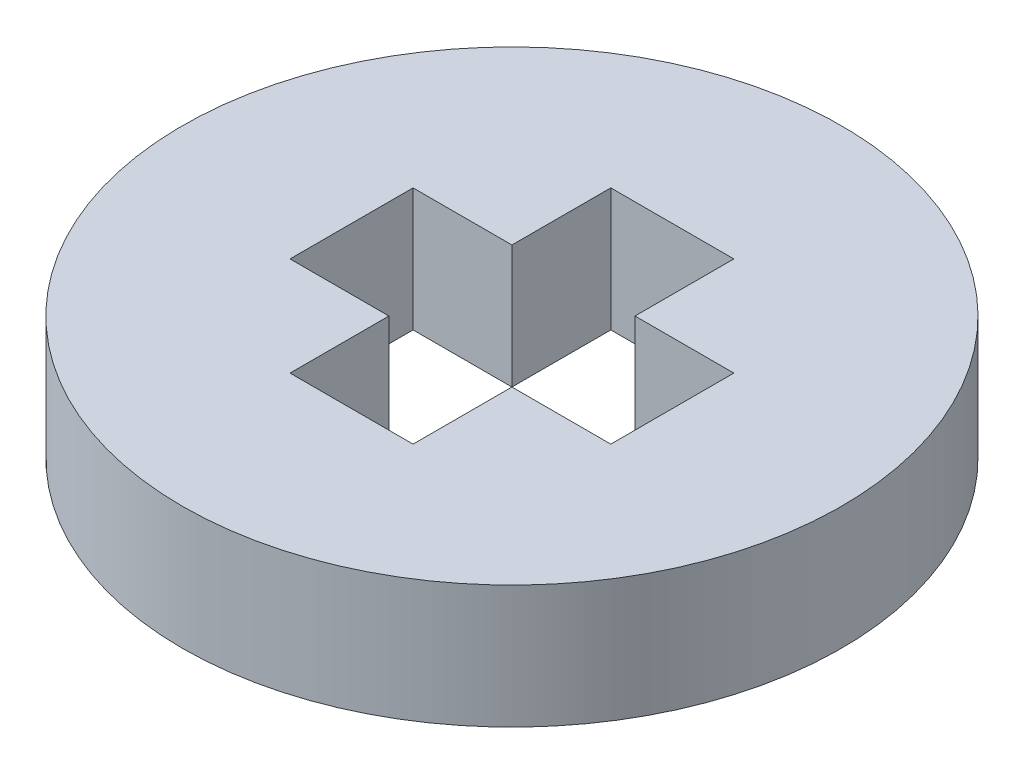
ISO-10303-21;
HEADER;
FILE_DESCRIPTION(('STEP AP214'),'2;1');
FILE_NAME('part.step','',(''),(''),'','','');
FILE_SCHEMA(('AUTOMOTIVE_DESIGN { 1 0 10303 214 1 1 1 1 }'));
ENDSEC;
DATA;
#1=APPLICATION_CONTEXT('core data for automotive mechanical design processes');
#2=APPLICATION_PROTOCOL_DEFINITION('international standard','automotive_design',2000,#1);
#3=PRODUCT_CONTEXT('',#1,'mechanical');
#4=PRODUCT('Part','Part','',(#3));
#5=PRODUCT_RELATED_PRODUCT_CATEGORY('part','',(#4));
#6=PRODUCT_DEFINITION_FORMATION('','',#4);
#7=PRODUCT_DEFINITION_CONTEXT('part definition',#1,'design');
#8=PRODUCT_DEFINITION('design','',#6,#7);
#9=PRODUCT_DEFINITION_SHAPE('','',#8);
#10=(LENGTH_UNIT() NAMED_UNIT(*) SI_UNIT(.MILLI.,.METRE.));
#11=(NAMED_UNIT(*) PLANE_ANGLE_UNIT() SI_UNIT($,.RADIAN.));
#12=(NAMED_UNIT(*) SI_UNIT($,.STERADIAN.) SOLID_ANGLE_UNIT());
#13=UNCERTAINTY_MEASURE_WITH_UNIT(LENGTH_MEASURE(1.E-05),#10,'distance_accuracy_value','');
#14=(GEOMETRIC_REPRESENTATION_CONTEXT(3) GLOBAL_UNCERTAINTY_ASSIGNED_CONTEXT((#13)) GLOBAL_UNIT_ASSIGNED_CONTEXT((#10,
#11,#12)) REPRESENTATION_CONTEXT('',''));
#15=CARTESIAN_POINT('',(0.,0.,0.));
#16=DIRECTION('',(0.,0.,1.));
#17=DIRECTION('',(1.,0.,0.));
#18=AXIS2_PLACEMENT_3D('',#15,#16,#17);
#19=CARTESIAN_POINT('',(0.,2.8,0.));
#20=DIRECTION('',(0.,1.,0.));
#21=DIRECTION('',(0.,0.,1.));
#22=AXIS2_PLACEMENT_3D('',#19,#20,#21);
#23=PLANE('',#22);
#24=CARTESIAN_POINT('',(0.,2.8,0.));
#25=DIRECTION('',(0.,1.,0.));
#26=DIRECTION('',(0.,0.,1.));
#27=AXIS2_PLACEMENT_3D('',#24,#25,#26);
#28=CIRCLE('',#27,7.5);
#29=CARTESIAN_POINT('',(0.,2.8,7.5));
#30=VERTEX_POINT('',#29);
#31=EDGE_CURVE('E11',#30,#30,#28,.T.);
#32=ORIENTED_EDGE('',*,*,#31,.T.);
#33=EDGE_LOOP('',(#32));
#34=FACE_BOUND('',#33,.T.);
#35=DIRECTION('',(-1.,0.,0.));
#36=VECTOR('',#35,1.);
#37=CARTESIAN_POINT('',(1.4,2.8,-3.65));
#38=LINE('',#37,#36);
#39=CARTESIAN_POINT('',(1.4,2.8,-3.65));
#40=VERTEX_POINT('',#39);
#41=CARTESIAN_POINT('',(-1.4,2.8,-3.65));
#42=VERTEX_POINT('',#41);
#43=EDGE_CURVE('E138',#40,#42,#38,.T.);
#44=ORIENTED_EDGE('',*,*,#43,.F.);
#45=DIRECTION('',(0.,0.,-1.));
#46=VECTOR('',#45,1.);
#47=CARTESIAN_POINT('',(1.4,2.8,-1.4));
#48=LINE('',#47,#46);
#49=CARTESIAN_POINT('',(1.4,2.8,-1.4));
#50=VERTEX_POINT('',#49);
#51=EDGE_CURVE('E130',#50,#40,#48,.T.);
#52=ORIENTED_EDGE('',*,*,#51,.F.);
#53=DIRECTION('',(-1.,0.,0.));
#54=VECTOR('',#53,1.);
#55=CARTESIAN_POINT('',(3.65,2.8,-1.4));
#56=LINE('',#55,#54);
#57=CARTESIAN_POINT('',(3.65,2.8,-1.4));
#58=VERTEX_POINT('',#57);
#59=EDGE_CURVE('E170',#58,#50,#56,.T.);
#60=ORIENTED_EDGE('',*,*,#59,.F.);
#61=DIRECTION('',(0.,0.,-1.));
#62=VECTOR('',#61,1.);
#63=CARTESIAN_POINT('',(3.65,2.8,1.4));
#64=LINE('',#63,#62);
#65=CARTESIAN_POINT('',(3.65,2.8,1.4));
#66=VERTEX_POINT('',#65);
#67=EDGE_CURVE('E168',#66,#58,#64,.T.);
#68=ORIENTED_EDGE('',*,*,#67,.F.);
#69=DIRECTION('',(1.,0.,0.));
#70=VECTOR('',#69,1.);
#71=CARTESIAN_POINT('',(1.4,2.8,1.4));
#72=LINE('',#71,#70);
#73=CARTESIAN_POINT('',(1.4,2.8,1.4));
#74=VERTEX_POINT('',#73);
#75=EDGE_CURVE('E166',#74,#66,#72,.T.);
#76=ORIENTED_EDGE('',*,*,#75,.F.);
#77=DIRECTION('',(0.,0.,-1.));
#78=VECTOR('',#77,1.);
#79=CARTESIAN_POINT('',(1.4,2.8,3.65));
#80=LINE('',#79,#78);
#81=CARTESIAN_POINT('',(1.4,2.8,3.65));
#82=VERTEX_POINT('',#81);
#83=EDGE_CURVE('E164',#82,#74,#80,.T.);
#84=ORIENTED_EDGE('',*,*,#83,.F.);
#85=DIRECTION('',(1.,0.,0.));
#86=VECTOR('',#85,1.);
#87=CARTESIAN_POINT('',(-1.4,2.8,3.65));
#88=LINE('',#87,#86);
#89=CARTESIAN_POINT('',(-1.4,2.8,3.65));
#90=VERTEX_POINT('',#89);
#91=EDGE_CURVE('E162',#90,#82,#88,.T.);
#92=ORIENTED_EDGE('',*,*,#91,.F.);
#93=DIRECTION('',(0.,0.,1.));
#94=VECTOR('',#93,1.);
#95=CARTESIAN_POINT('',(-1.4,2.8,1.4));
#96=LINE('',#95,#94);
#97=CARTESIAN_POINT('',(-1.4,2.8,1.4));
#98=VERTEX_POINT('',#97);
#99=EDGE_CURVE('E160',#98,#90,#96,.T.);
#100=ORIENTED_EDGE('',*,*,#99,.F.);
#101=DIRECTION('',(1.,0.,0.));
#102=VECTOR('',#101,1.);
#103=CARTESIAN_POINT('',(-3.65,2.8,1.4));
#104=LINE('',#103,#102);
#105=CARTESIAN_POINT('',(-3.65,2.8,1.4));
#106=VERTEX_POINT('',#105);
#107=EDGE_CURVE('E158',#106,#98,#104,.T.);
#108=ORIENTED_EDGE('',*,*,#107,.F.);
#109=DIRECTION('',(0.,0.,1.));
#110=VECTOR('',#109,1.);
#111=CARTESIAN_POINT('',(-3.65,2.8,-1.4));
#112=LINE('',#111,#110);
#113=CARTESIAN_POINT('',(-3.65,2.8,-1.4));
#114=VERTEX_POINT('',#113);
#115=EDGE_CURVE('E156',#114,#106,#112,.T.);
#116=ORIENTED_EDGE('',*,*,#115,.F.);
#117=DIRECTION('',(-1.,0.,0.));
#118=VECTOR('',#117,1.);
#119=CARTESIAN_POINT('',(-1.4,2.8,-1.4));
#120=LINE('',#119,#118);
#121=CARTESIAN_POINT('',(-1.4,2.8,-1.4));
#122=VERTEX_POINT('',#121);
#123=EDGE_CURVE('E152',#122,#114,#120,.T.);
#124=ORIENTED_EDGE('',*,*,#123,.F.);
#125=DIRECTION('',(0.,0.,1.));
#126=VECTOR('',#125,1.);
#127=CARTESIAN_POINT('',(-1.4,2.8,-3.65));
#128=LINE('',#127,#126);
#129=EDGE_CURVE('E150',#42,#122,#128,.T.);
#130=ORIENTED_EDGE('',*,*,#129,.F.);
#131=EDGE_LOOP('',(#44,#52,#60,#68,#76,#84,#92,#100,#108,#116,#124,#130));
#132=FACE_BOUND('',#131,.T.);
#133=ADVANCED_FACE('F41',(#34,#132),#23,.T.);
#134=CARTESIAN_POINT('',(0.,0.,0.));
#135=DIRECTION('',(0.,1.,0.));
#136=DIRECTION('',(0.,0.,1.));
#137=AXIS2_PLACEMENT_3D('',#134,#135,#136);
#138=PLANE('',#137);
#139=CARTESIAN_POINT('',(0.,0.,0.));
#140=DIRECTION('',(0.,1.,0.));
#141=DIRECTION('',(0.,0.,1.));
#142=AXIS2_PLACEMENT_3D('',#139,#140,#141);
#143=CIRCLE('',#142,7.5);
#144=CARTESIAN_POINT('',(0.,0.,7.5));
#145=VERTEX_POINT('',#144);
#146=EDGE_CURVE('E45',#145,#145,#143,.T.);
#147=ORIENTED_EDGE('',*,*,#146,.F.);
#148=EDGE_LOOP('',(#147));
#149=FACE_BOUND('',#148,.T.);
#150=DIRECTION('',(0.,0.,-1.));
#151=VECTOR('',#150,1.);
#152=CARTESIAN_POINT('',(1.4,0.,-1.4));
#153=LINE('',#152,#151);
#154=CARTESIAN_POINT('',(1.4,0.,-1.4));
#155=VERTEX_POINT('',#154);
#156=CARTESIAN_POINT('',(1.4,0.,-3.65));
#157=VERTEX_POINT('',#156);
#158=EDGE_CURVE('E64',#155,#157,#153,.T.);
#159=ORIENTED_EDGE('',*,*,#158,.T.);
#160=DIRECTION('',(-1.,0.,0.));
#161=VECTOR('',#160,1.);
#162=CARTESIAN_POINT('',(1.4,0.,-3.65));
#163=LINE('',#162,#161);
#164=CARTESIAN_POINT('',(-1.4,0.,-3.65));
#165=VERTEX_POINT('',#164);
#166=EDGE_CURVE('E145',#157,#165,#163,.T.);
#167=ORIENTED_EDGE('',*,*,#166,.T.);
#168=DIRECTION('',(0.,0.,1.));
#169=VECTOR('',#168,1.);
#170=CARTESIAN_POINT('',(-1.4,0.,-3.65));
#171=LINE('',#170,#169);
#172=CARTESIAN_POINT('',(-1.4,0.,-1.4));
#173=VERTEX_POINT('',#172);
#174=EDGE_CURVE('E174',#165,#173,#171,.T.);
#175=ORIENTED_EDGE('',*,*,#174,.T.);
#176=DIRECTION('',(-1.,0.,0.));
#177=VECTOR('',#176,1.);
#178=CARTESIAN_POINT('',(-1.4,0.,-1.4));
#179=LINE('',#178,#177);
#180=CARTESIAN_POINT('',(-3.65,0.,-1.4));
#181=VERTEX_POINT('',#180);
#182=EDGE_CURVE('E177',#173,#181,#179,.T.);
#183=ORIENTED_EDGE('',*,*,#182,.T.);
#184=DIRECTION('',(0.,0.,1.));
#185=VECTOR('',#184,1.);
#186=CARTESIAN_POINT('',(-3.65,0.,-1.4));
#187=LINE('',#186,#185);
#188=CARTESIAN_POINT('',(-3.65,0.,1.4));
#189=VERTEX_POINT('',#188);
#190=EDGE_CURVE('E180',#181,#189,#187,.T.);
#191=ORIENTED_EDGE('',*,*,#190,.T.);
#192=DIRECTION('',(1.,0.,0.));
#193=VECTOR('',#192,1.);
#194=CARTESIAN_POINT('',(-3.65,0.,1.4));
#195=LINE('',#194,#193);
#196=CARTESIAN_POINT('',(-1.4,0.,1.4));
#197=VERTEX_POINT('',#196);
#198=EDGE_CURVE('E183',#189,#197,#195,.T.);
#199=ORIENTED_EDGE('',*,*,#198,.T.);
#200=DIRECTION('',(0.,0.,1.));
#201=VECTOR('',#200,1.);
#202=CARTESIAN_POINT('',(-1.4,0.,1.4));
#203=LINE('',#202,#201);
#204=CARTESIAN_POINT('',(-1.4,0.,3.65));
#205=VERTEX_POINT('',#204);
#206=EDGE_CURVE('E186',#197,#205,#203,.T.);
#207=ORIENTED_EDGE('',*,*,#206,.T.);
#208=DIRECTION('',(1.,0.,0.));
#209=VECTOR('',#208,1.);
#210=CARTESIAN_POINT('',(-1.4,0.,3.65));
#211=LINE('',#210,#209);
#212=CARTESIAN_POINT('',(1.4,0.,3.65));
#213=VERTEX_POINT('',#212);
#214=EDGE_CURVE('E189',#205,#213,#211,.T.);
#215=ORIENTED_EDGE('',*,*,#214,.T.);
#216=DIRECTION('',(0.,0.,-1.));
#217=VECTOR('',#216,1.);
#218=CARTESIAN_POINT('',(1.4,0.,3.65));
#219=LINE('',#218,#217);
#220=CARTESIAN_POINT('',(1.4,0.,1.4));
#221=VERTEX_POINT('',#220);
#222=EDGE_CURVE('E192',#213,#221,#219,.T.);
#223=ORIENTED_EDGE('',*,*,#222,.T.);
#224=DIRECTION('',(1.,0.,0.));
#225=VECTOR('',#224,1.);
#226=CARTESIAN_POINT('',(1.4,0.,1.4));
#227=LINE('',#226,#225);
#228=CARTESIAN_POINT('',(3.65,0.,1.4));
#229=VERTEX_POINT('',#228);
#230=EDGE_CURVE('E195',#221,#229,#227,.T.);
#231=ORIENTED_EDGE('',*,*,#230,.T.);
#232=DIRECTION('',(0.,0.,-1.));
#233=VECTOR('',#232,1.);
#234=CARTESIAN_POINT('',(3.65,0.,1.4));
#235=LINE('',#234,#233);
#236=CARTESIAN_POINT('',(3.65,0.,-1.4));
#237=VERTEX_POINT('',#236);
#238=EDGE_CURVE('E198',#229,#237,#235,.T.);
#239=ORIENTED_EDGE('',*,*,#238,.T.);
#240=DIRECTION('',(-1.,0.,0.));
#241=VECTOR('',#240,1.);
#242=CARTESIAN_POINT('',(3.65,0.,-1.4));
#243=LINE('',#242,#241);
#244=EDGE_CURVE('E139',#237,#155,#243,.T.);
#245=ORIENTED_EDGE('',*,*,#244,.T.);
#246=EDGE_LOOP('',(#159,#167,#175,#183,#191,#199,#207,#215,#223,#231,#239,#245));
#247=FACE_BOUND('',#246,.T.);
#248=ADVANCED_FACE('F227',(#149,#247),#138,.F.);
#249=CARTESIAN_POINT('',(0.,2.8,0.));
#250=DIRECTION('',(0.,-1.,0.));
#251=DIRECTION('',(0.,0.,-1.));
#252=AXIS2_PLACEMENT_3D('',#249,#250,#251);
#253=CYLINDRICAL_SURFACE('',#252,7.5);
#254=ORIENTED_EDGE('',*,*,#31,.F.);
#255=EDGE_LOOP('',(#254));
#256=FACE_BOUND('',#255,.T.);
#257=ORIENTED_EDGE('',*,*,#146,.T.);
#258=EDGE_LOOP('',(#257));
#259=FACE_BOUND('',#258,.T.);
#260=ADVANCED_FACE('F43',(#256,#259),#253,.T.);
#261=CARTESIAN_POINT('',(1.4,2.8,-1.4));
#262=DIRECTION('',(-1.,0.,0.));
#263=DIRECTION('',(0.,0.,1.));
#264=AXIS2_PLACEMENT_3D('',#261,#262,#263);
#265=PLANE('',#264);
#266=ORIENTED_EDGE('',*,*,#158,.F.);
#267=DIRECTION('',(0.,-1.,0.));
#268=VECTOR('',#267,1.);
#269=CARTESIAN_POINT('',(1.4,2.8,-1.4));
#270=LINE('',#269,#268);
#271=EDGE_CURVE('E134',#50,#155,#270,.T.);
#272=ORIENTED_EDGE('',*,*,#271,.F.);
#273=ORIENTED_EDGE('',*,*,#51,.T.);
#274=DIRECTION('',(0.,-1.,0.));
#275=VECTOR('',#274,1.);
#276=CARTESIAN_POINT('',(1.4,2.8,-3.65));
#277=LINE('',#276,#275);
#278=EDGE_CURVE('E133',#40,#157,#277,.T.);
#279=ORIENTED_EDGE('',*,*,#278,.T.);
#280=EDGE_LOOP('',(#266,#272,#273,#279));
#281=FACE_BOUND('',#280,.T.);
#282=ADVANCED_FACE('F132',(#281),#265,.T.);
#283=CARTESIAN_POINT('',(1.4,2.8,-3.65));
#284=DIRECTION('',(0.,0.,1.));
#285=DIRECTION('',(1.,0.,0.));
#286=AXIS2_PLACEMENT_3D('',#283,#284,#285);
#287=PLANE('',#286);
#288=ORIENTED_EDGE('',*,*,#166,.F.);
#289=ORIENTED_EDGE('',*,*,#278,.F.);
#290=ORIENTED_EDGE('',*,*,#43,.T.);
#291=DIRECTION('',(0.,-1.,0.));
#292=VECTOR('',#291,1.);
#293=CARTESIAN_POINT('',(-1.4,2.8,-3.65));
#294=LINE('',#293,#292);
#295=EDGE_CURVE('E146',#42,#165,#294,.T.);
#296=ORIENTED_EDGE('',*,*,#295,.T.);
#297=EDGE_LOOP('',(#288,#289,#290,#296));
#298=FACE_BOUND('',#297,.T.);
#299=ADVANCED_FACE('F142',(#298),#287,.T.);
#300=CARTESIAN_POINT('',(-1.4,2.8,-3.65));
#301=DIRECTION('',(1.,0.,0.));
#302=DIRECTION('',(0.,0.,-1.));
#303=AXIS2_PLACEMENT_3D('',#300,#301,#302);
#304=PLANE('',#303);
#305=ORIENTED_EDGE('',*,*,#174,.F.);
#306=ORIENTED_EDGE('',*,*,#295,.F.);
#307=ORIENTED_EDGE('',*,*,#129,.T.);
#308=DIRECTION('',(0.,-1.,0.));
#309=VECTOR('',#308,1.);
#310=CARTESIAN_POINT('',(-1.4,2.8,-1.4));
#311=LINE('',#310,#309);
#312=EDGE_CURVE('E219',#122,#173,#311,.T.);
#313=ORIENTED_EDGE('',*,*,#312,.T.);
#314=EDGE_LOOP('',(#305,#306,#307,#313));
#315=FACE_BOUND('',#314,.T.);
#316=ADVANCED_FACE('F223',(#315),#304,.T.);
#317=CARTESIAN_POINT('',(-1.4,2.8,-1.4));
#318=DIRECTION('',(0.,0.,1.));
#319=DIRECTION('',(1.,0.,0.));
#320=AXIS2_PLACEMENT_3D('',#317,#318,#319);
#321=PLANE('',#320);
#322=ORIENTED_EDGE('',*,*,#182,.F.);
#323=ORIENTED_EDGE('',*,*,#312,.F.);
#324=ORIENTED_EDGE('',*,*,#123,.T.);
#325=DIRECTION('',(0.,-1.,0.));
#326=VECTOR('',#325,1.);
#327=CARTESIAN_POINT('',(-3.65,2.8,-1.4));
#328=LINE('',#327,#326);
#329=EDGE_CURVE('E217',#114,#181,#328,.T.);
#330=ORIENTED_EDGE('',*,*,#329,.T.);
#331=EDGE_LOOP('',(#322,#323,#324,#330));
#332=FACE_BOUND('',#331,.T.);
#333=ADVANCED_FACE('F265',(#332),#321,.T.);
#334=CARTESIAN_POINT('',(-3.65,2.8,-1.4));
#335=DIRECTION('',(1.,0.,0.));
#336=DIRECTION('',(0.,0.,-1.));
#337=AXIS2_PLACEMENT_3D('',#334,#335,#336);
#338=PLANE('',#337);
#339=ORIENTED_EDGE('',*,*,#190,.F.);
#340=ORIENTED_EDGE('',*,*,#329,.F.);
#341=ORIENTED_EDGE('',*,*,#115,.T.);
#342=DIRECTION('',(0.,-1.,0.));
#343=VECTOR('',#342,1.);
#344=CARTESIAN_POINT('',(-3.65,2.8,1.4));
#345=LINE('',#344,#343);
#346=EDGE_CURVE('E215',#106,#189,#345,.T.);
#347=ORIENTED_EDGE('',*,*,#346,.T.);
#348=EDGE_LOOP('',(#339,#340,#341,#347));
#349=FACE_BOUND('',#348,.T.);
#350=ADVANCED_FACE('F263',(#349),#338,.T.);
#351=CARTESIAN_POINT('',(-3.65,2.8,1.4));
#352=DIRECTION('',(0.,0.,-1.));
#353=DIRECTION('',(-1.,0.,0.));
#354=AXIS2_PLACEMENT_3D('',#351,#352,#353);
#355=PLANE('',#354);
#356=ORIENTED_EDGE('',*,*,#198,.F.);
#357=ORIENTED_EDGE('',*,*,#346,.F.);
#358=ORIENTED_EDGE('',*,*,#107,.T.);
#359=DIRECTION('',(0.,-1.,0.));
#360=VECTOR('',#359,1.);
#361=CARTESIAN_POINT('',(-1.4,2.8,1.4));
#362=LINE('',#361,#360);
#363=EDGE_CURVE('E213',#98,#197,#362,.T.);
#364=ORIENTED_EDGE('',*,*,#363,.T.);
#365=EDGE_LOOP('',(#356,#357,#358,#364));
#366=FACE_BOUND('',#365,.T.);
#367=ADVANCED_FACE('F257',(#366),#355,.T.);
#368=CARTESIAN_POINT('',(-1.4,2.8,1.4));
#369=DIRECTION('',(1.,0.,0.));
#370=DIRECTION('',(0.,0.,-1.));
#371=AXIS2_PLACEMENT_3D('',#368,#369,#370);
#372=PLANE('',#371);
#373=ORIENTED_EDGE('',*,*,#206,.F.);
#374=ORIENTED_EDGE('',*,*,#363,.F.);
#375=ORIENTED_EDGE('',*,*,#99,.T.);
#376=DIRECTION('',(0.,-1.,0.));
#377=VECTOR('',#376,1.);
#378=CARTESIAN_POINT('',(-1.4,2.8,3.65));
#379=LINE('',#378,#377);
#380=EDGE_CURVE('E211',#90,#205,#379,.T.);
#381=ORIENTED_EDGE('',*,*,#380,.T.);
#382=EDGE_LOOP('',(#373,#374,#375,#381));
#383=FACE_BOUND('',#382,.T.);
#384=ADVANCED_FACE('F253',(#383),#372,.T.);
#385=CARTESIAN_POINT('',(-1.4,2.8,3.65));
#386=DIRECTION('',(0.,0.,-1.));
#387=DIRECTION('',(-1.,0.,0.));
#388=AXIS2_PLACEMENT_3D('',#385,#386,#387);
#389=PLANE('',#388);
#390=ORIENTED_EDGE('',*,*,#214,.F.);
#391=ORIENTED_EDGE('',*,*,#380,.F.);
#392=ORIENTED_EDGE('',*,*,#91,.T.);
#393=DIRECTION('',(0.,-1.,0.));
#394=VECTOR('',#393,1.);
#395=CARTESIAN_POINT('',(1.4,2.8,3.65));
#396=LINE('',#395,#394);
#397=EDGE_CURVE('E209',#82,#213,#396,.T.);
#398=ORIENTED_EDGE('',*,*,#397,.T.);
#399=EDGE_LOOP('',(#390,#391,#392,#398));
#400=FACE_BOUND('',#399,.T.);
#401=ADVANCED_FACE('F250',(#400),#389,.T.);
#402=CARTESIAN_POINT('',(1.4,2.8,3.65));
#403=DIRECTION('',(-1.,0.,0.));
#404=DIRECTION('',(0.,0.,1.));
#405=AXIS2_PLACEMENT_3D('',#402,#403,#404);
#406=PLANE('',#405);
#407=ORIENTED_EDGE('',*,*,#222,.F.);
#408=ORIENTED_EDGE('',*,*,#397,.F.);
#409=ORIENTED_EDGE('',*,*,#83,.T.);
#410=DIRECTION('',(0.,-1.,0.));
#411=VECTOR('',#410,1.);
#412=CARTESIAN_POINT('',(1.4,2.8,1.4));
#413=LINE('',#412,#411);
#414=EDGE_CURVE('E207',#74,#221,#413,.T.);
#415=ORIENTED_EDGE('',*,*,#414,.T.);
#416=EDGE_LOOP('',(#407,#408,#409,#415));
#417=FACE_BOUND('',#416,.T.);
#418=ADVANCED_FACE('F242',(#417),#406,.T.);
#419=CARTESIAN_POINT('',(1.4,2.8,1.4));
#420=DIRECTION('',(0.,0.,-1.));
#421=DIRECTION('',(-1.,0.,0.));
#422=AXIS2_PLACEMENT_3D('',#419,#420,#421);
#423=PLANE('',#422);
#424=ORIENTED_EDGE('',*,*,#230,.F.);
#425=ORIENTED_EDGE('',*,*,#414,.F.);
#426=ORIENTED_EDGE('',*,*,#75,.T.);
#427=DIRECTION('',(0.,-1.,0.));
#428=VECTOR('',#427,1.);
#429=CARTESIAN_POINT('',(3.65,2.8,1.4));
#430=LINE('',#429,#428);
#431=EDGE_CURVE('E205',#66,#229,#430,.T.);
#432=ORIENTED_EDGE('',*,*,#431,.T.);
#433=EDGE_LOOP('',(#424,#425,#426,#432));
#434=FACE_BOUND('',#433,.T.);
#435=ADVANCED_FACE('F238',(#434),#423,.T.);
#436=CARTESIAN_POINT('',(3.65,2.8,1.4));
#437=DIRECTION('',(-1.,0.,0.));
#438=DIRECTION('',(0.,0.,1.));
#439=AXIS2_PLACEMENT_3D('',#436,#437,#438);
#440=PLANE('',#439);
#441=ORIENTED_EDGE('',*,*,#238,.F.);
#442=ORIENTED_EDGE('',*,*,#431,.F.);
#443=ORIENTED_EDGE('',*,*,#67,.T.);
#444=DIRECTION('',(0.,-1.,0.));
#445=VECTOR('',#444,1.);
#446=CARTESIAN_POINT('',(3.65,2.8,-1.4));
#447=LINE('',#446,#445);
#448=EDGE_CURVE('E56',#58,#237,#447,.T.);
#449=ORIENTED_EDGE('',*,*,#448,.T.);
#450=EDGE_LOOP('',(#441,#442,#443,#449));
#451=FACE_BOUND('',#450,.T.);
#452=ADVANCED_FACE('F235',(#451),#440,.T.);
#453=CARTESIAN_POINT('',(3.65,2.8,-1.4));
#454=DIRECTION('',(0.,0.,1.));
#455=DIRECTION('',(1.,0.,0.));
#456=AXIS2_PLACEMENT_3D('',#453,#454,#455);
#457=PLANE('',#456);
#458=ORIENTED_EDGE('',*,*,#244,.F.);
#459=ORIENTED_EDGE('',*,*,#448,.F.);
#460=ORIENTED_EDGE('',*,*,#59,.T.);
#461=ORIENTED_EDGE('',*,*,#271,.T.);
#462=EDGE_LOOP('',(#458,#459,#460,#461));
#463=FACE_BOUND('',#462,.T.);
#464=ADVANCED_FACE('F229',(#463),#457,.T.);
#465=CLOSED_SHELL('',(#133,#248,#260,#282,#299,#316,#333,#350,#367,#384,#401,#418,#435,#452,#464));
#466=MANIFOLD_SOLID_BREP('B2',#465);
#467=ADVANCED_BREP_SHAPE_REPRESENTATION('',(#18,#466),#14);
#468=SHAPE_DEFINITION_REPRESENTATION(#9,#467);
ENDSEC;
END-ISO-10303-21;
